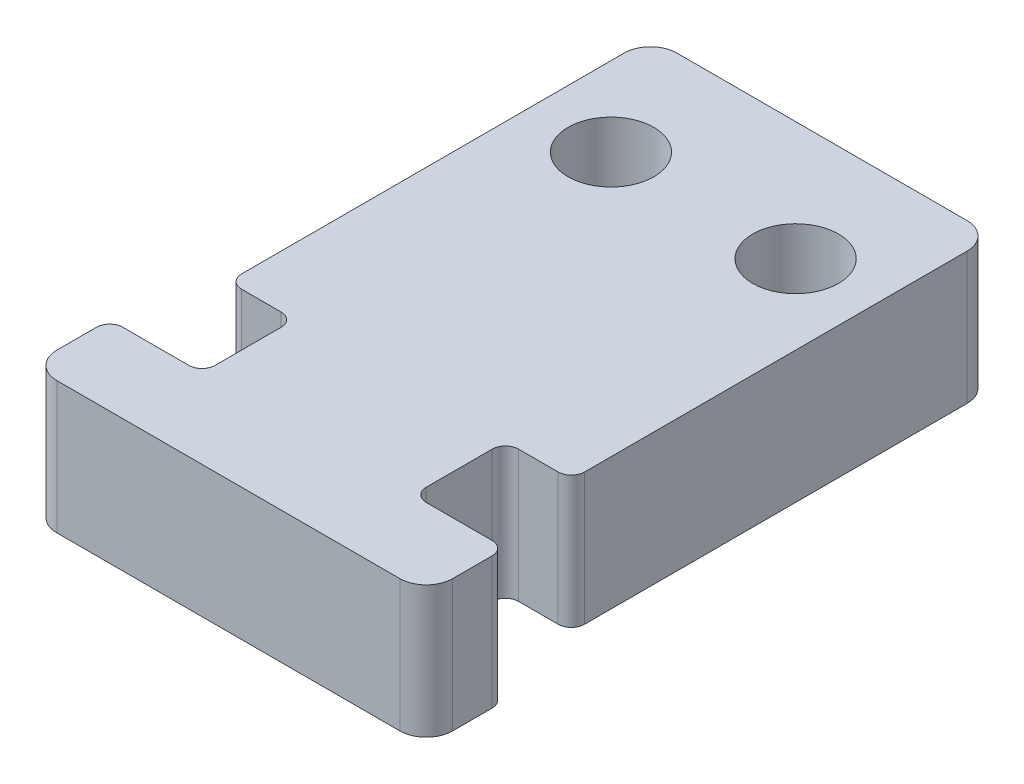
from build123d import *

# Parameters (mm, degrees)
BOSS_EXTRUDE1_DEPTH = 10
FILLET1_R           = 2
FILLET2_R           = 1
SKETCH2_R           = 3.25
CUT_EXTRUDE1_DEPTH  = 49.476798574


with BuildPart() as part:
    # Sketch1 → Boss-Extrude1 (new body)
    with BuildSketch(Plane(origin=(0, 0, 0), x_dir=(1, 0, 0), z_dir=(0, 1, 0))):
        Polygon((13, 45), (-13, 45), (-13, 13), (-8, 13), (-8, 6), (-15, 6), (-15, 0), (15, 0), (15, 6), (8, 6), (8, 13), (13, 13), align=None)
    extrude(amount=BOSS_EXTRUDE1_DEPTH)

    # Fillet1
    fillet1_edges = [part.edges().sort_by_distance(p)[0] for p in [
        (-13, 5, -45),
        (13, 5, -45),
        (15, 5, 0),
        (-15, 5, 0),
    ]]
    fillet(fillet1_edges, radius=FILLET1_R)

    # Fillet2
    fillet2_edges = [part.edges().sort_by_distance(p)[0] for p in [
        (-15, 5, -6),
        (-8, 5, -6),
        (-8, 5, -13),
        (-13, 5, -13),
        (13, 5, -13),
        (8, 5, -13),
        (8, 5, -6),
        (15, 5, -6),
    ]]
    fillet(fillet2_edges, radius=FILLET2_R)

    # Sketch2 → Cut-Extrude1 (cut, through all)
    with BuildSketch(Plane(origin=(0, 10, 0), x_dir=(1, 0, 0), z_dir=(0, 1, 0))):
        with Locations(Location((7, 36, 0), (0, 0, 270))):
            Circle(SKETCH2_R)
    cut_extrude1 = extrude(amount=-CUT_EXTRUDE1_DEPTH, mode=Mode.SUBTRACT)

    # Mirror1: Cut-Extrude1 across plane
    add(cut_extrude1.mirror(Plane(origin=(0, 0, 0), x_dir=(0, 0, 1), z_dir=(1, 0, 0))), mode=Mode.SUBTRACT)


solid = part.part
